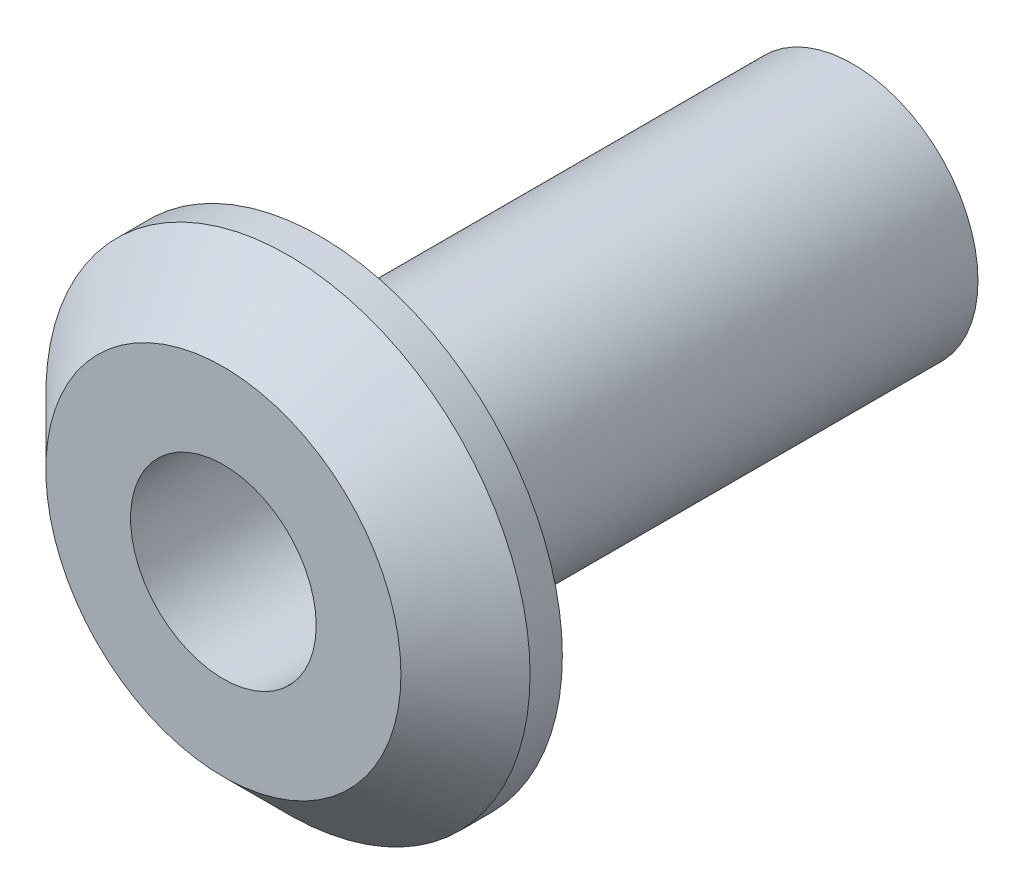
from build123d import *
from build123d.topology import SkipClean

# Parameters (mm, degrees)
CROQUIS1_R              = 7.5
CROQUIS1_R_2            = 1.55
SALIENTE_EXTRUIR1_DEPTH = 1.5
CHAFL_N1_SIZE           = 2
SALIENTE_EXTRUIR2_START = 16.5
CROQUIS2_R              = 3.875
CROQUIS2_R_2            = 1.55
SALIENTE_EXTRUIR2_DEPTH = 16.5
CROQUIS3_R              = 2.875
CORTAR_EXTRUIR1_DEPTH   = 7.5


with BuildPart() as part:
    # Croquis1 → Saliente-Extruir1 (new, symmetric)
    with BuildSketch(Plane.XY):
        Circle(CROQUIS1_R)
        Circle(CROQUIS1_R_2, mode=Mode.SUBTRACT)
    extrude(amount=SALIENTE_EXTRUIR1_DEPTH, both=True)

    # Chafl_n1
    chafl_n1_edges = [part.edges().sort_by_distance(p)[0] for p in [
        (-7.5, 0, 1.5),
    ]]
    chamfer(chafl_n1_edges, length=CHAFL_N1_SIZE)

    # Croquis2 → Saliente-Extruir2 (add)
    with SkipClean():  # the faces are left unmerged after this step: merging them gives an invalid solid
        with BuildSketch(Plane(origin=(0, 0, -1.5), x_dir=(-1, 0, 0), z_dir=(0, 0, -1)).offset(SALIENTE_EXTRUIR2_START)):
            with Locations(Location((0, 0, 0), (0, 0, 180))):
                Circle(CROQUIS2_R)
            Circle(CROQUIS2_R_2, mode=Mode.SUBTRACT)
        extrude(amount=-SALIENTE_EXTRUIR2_DEPTH)

    # Croquis3 → Cortar-Extruir1 (cut)
    with BuildSketch(Plane.XY.offset(1.5)):
        Circle(CROQUIS3_R)
    extrude(amount=-CORTAR_EXTRUIR1_DEPTH, mode=Mode.SUBTRACT)


solid = part.part
